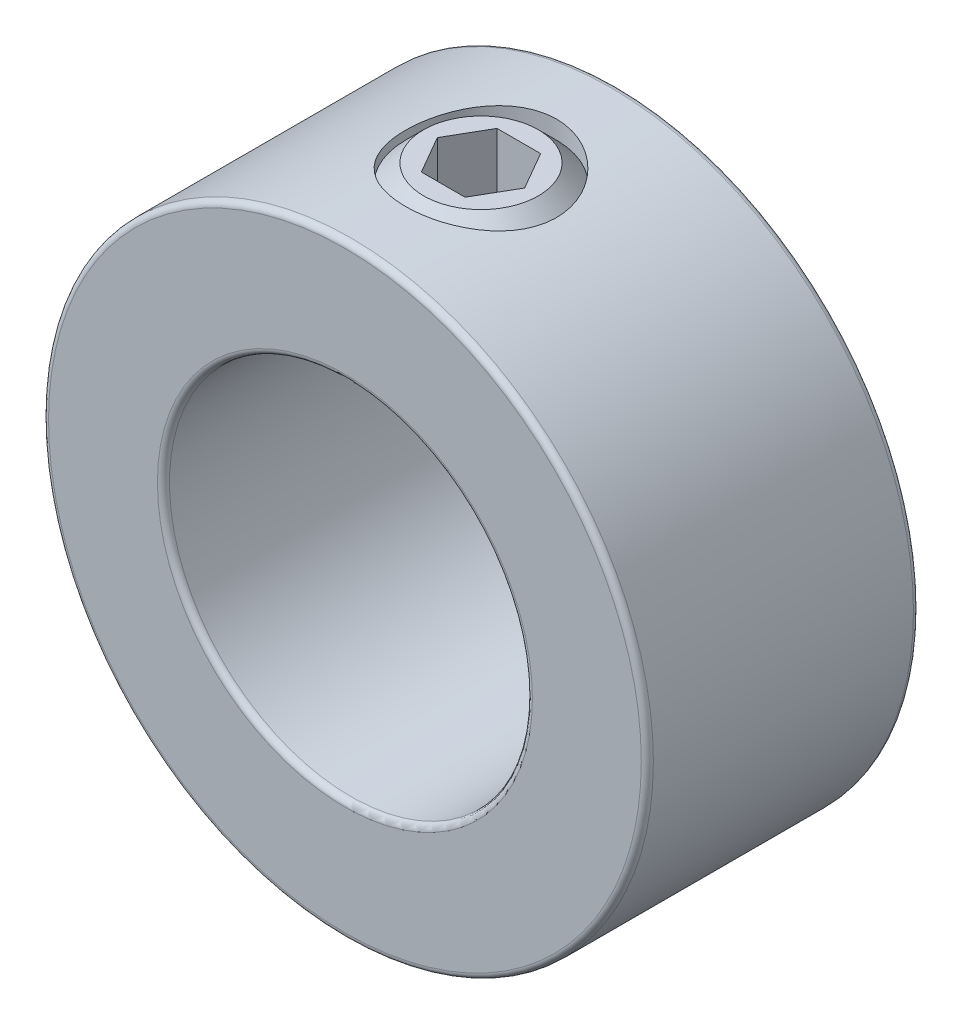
from build123d import *

# Parameters (mm, degrees)
SKETCH1_R          = 15.875
SKETCH1_R_2        = 9.525
EXTRUDE1_DEPTH     = 7.14375
SKETCH2_R          = 3.96875
CUT_EXTRUDE1_DEPTH = 60.742541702
FILLET1_R          = 0.3175
CUT_EXTRUDE2_DEPTH = 3.96875


with BuildPart() as part:
    # Sketch1 → Extrude1 (new, symmetric)
    with BuildSketch(Plane.XY):
        Circle(SKETCH1_R)
        Circle(SKETCH1_R_2, mode=Mode.SUBTRACT)
    extrude(amount=EXTRUDE1_DEPTH, both=True)

    # Sketch2 → Cut-Extrude1 (cut, through all)
    with BuildSketch(Plane(origin=(41.275, 0, 0), x_dir=(0, 0, -1), z_dir=(0, -1, 0))):
        with Locations((0, -41.275)):
            Circle(SKETCH2_R)
    extrude(amount=-CUT_EXTRUDE1_DEPTH, mode=Mode.SUBTRACT)

    # Fillet1
    fillet1_edges = [part.edges().sort_by_distance(p)[0] for p in [
        (-15.875, 0, -7.14375),
        (-15.875, 0, 7.14375),
        (-9.525, 0, -7.14375),
        (-9.525, 0, 7.14375),
    ]]
    fillet(fillet1_edges, radius=FILLET1_R)


with BuildPart() as body_2:
    # Sketch3 → Revolve1 (revolve)
    with BuildSketch(Plane.XY):
        Polygon((-3.010240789, 9.525), (-1.150211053, 9.525), (0, 10.675211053), (0, 15.875), (-3.010240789, 15.875), (-3.96875, 14.916490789), (-3.96875, 10.483509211), align=None)
    revolve(axis=Axis((0, 9.525, 0), (0, -1, 0)))

    # Sketch4 → Cut-Extrude2 (cut)
    with BuildSketch(Plane(origin=(3.3734375, 15.875, 0), x_dir=(0, 0, -1), z_dir=(0, -1, 0))):
        Polygon((0, -1.082078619), (-1.984375, -2.22775806), (-1.984375, -4.51911694), (0, -5.664796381), (1.984375, -4.51911694), (1.984375, -2.22775806), align=None)
    extrude(amount=CUT_EXTRUDE2_DEPTH, mode=Mode.SUBTRACT)


solid = Compound([part.part, body_2.part])
